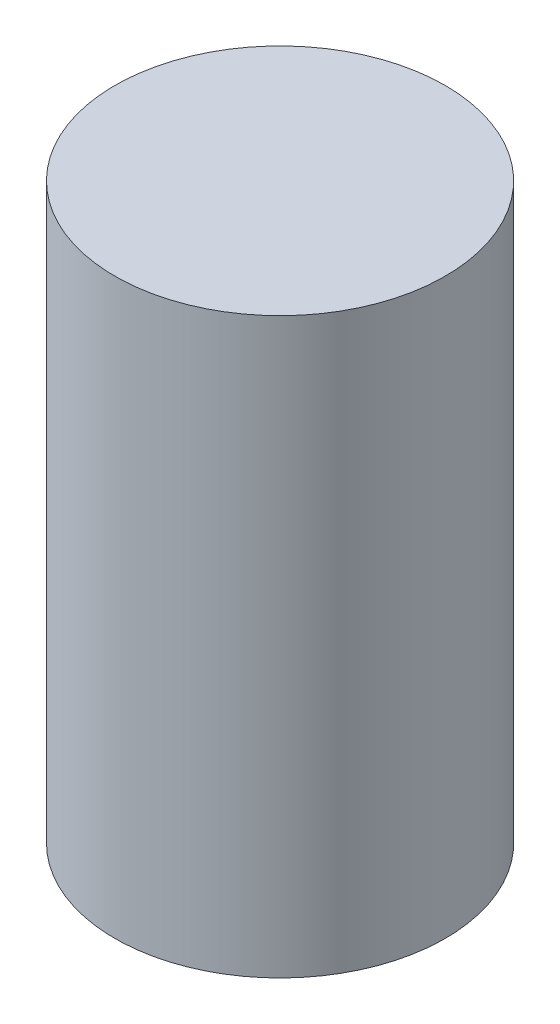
ISO-10303-21;
HEADER;
FILE_DESCRIPTION(('STEP AP214'),'2;1');
FILE_NAME('part.step','',(''),(''),'','','');
FILE_SCHEMA(('AUTOMOTIVE_DESIGN { 1 0 10303 214 1 1 1 1 }'));
ENDSEC;
DATA;
#1=APPLICATION_CONTEXT('core data for automotive mechanical design processes');
#2=APPLICATION_PROTOCOL_DEFINITION('international standard','automotive_design',2000,#1);
#3=PRODUCT_CONTEXT('',#1,'mechanical');
#4=PRODUCT('Part','Part','',(#3));
#5=PRODUCT_RELATED_PRODUCT_CATEGORY('part','',(#4));
#6=PRODUCT_DEFINITION_FORMATION('','',#4);
#7=PRODUCT_DEFINITION_CONTEXT('part definition',#1,'design');
#8=PRODUCT_DEFINITION('design','',#6,#7);
#9=PRODUCT_DEFINITION_SHAPE('','',#8);
#10=(LENGTH_UNIT() NAMED_UNIT(*) SI_UNIT(.MILLI.,.METRE.));
#11=(NAMED_UNIT(*) PLANE_ANGLE_UNIT() SI_UNIT($,.RADIAN.));
#12=(NAMED_UNIT(*) SI_UNIT($,.STERADIAN.) SOLID_ANGLE_UNIT());
#13=UNCERTAINTY_MEASURE_WITH_UNIT(LENGTH_MEASURE(1.E-05),#10,'distance_accuracy_value','');
#14=(GEOMETRIC_REPRESENTATION_CONTEXT(3) GLOBAL_UNCERTAINTY_ASSIGNED_CONTEXT((#13)) GLOBAL_UNIT_ASSIGNED_CONTEXT((#10,
#11,#12)) REPRESENTATION_CONTEXT('',''));
#15=CARTESIAN_POINT('',(0.,0.,0.));
#16=DIRECTION('',(0.,0.,1.));
#17=DIRECTION('',(1.,0.,0.));
#18=AXIS2_PLACEMENT_3D('',#15,#16,#17);
#19=CARTESIAN_POINT('',(0.,11.938,0.));
#20=DIRECTION('',(0.,-1.,0.));
#21=DIRECTION('',(0.,0.,-1.));
#22=AXIS2_PLACEMENT_3D('',#19,#20,#21);
#23=CYLINDRICAL_SURFACE('',#22,2.9845);
#24=CARTESIAN_POINT('',(0.,-10.3632,0.));
#25=DIRECTION('',(0.,-1.,0.));
#26=DIRECTION('',(0.,0.,-1.));
#27=AXIS2_PLACEMENT_3D('',#24,#25,#26);
#28=CIRCLE('',#27,2.9845);
#29=CARTESIAN_POINT('',(0.,-10.3632,-2.9845));
#30=VERTEX_POINT('',#29);
#31=EDGE_CURVE('E11',#30,#30,#28,.T.);
#32=ORIENTED_EDGE('',*,*,#31,.F.);
#33=EDGE_LOOP('',(#32));
#34=FACE_BOUND('',#33,.T.);
#35=CARTESIAN_POINT('',(0.,0.,0.));
#36=DIRECTION('',(0.,-1.,0.));
#37=DIRECTION('',(0.,0.,-1.));
#38=AXIS2_PLACEMENT_3D('',#35,#36,#37);
#39=CIRCLE('',#38,2.9845);
#40=CARTESIAN_POINT('',(0.,0.,-2.9845));
#41=VERTEX_POINT('',#40);
#42=EDGE_CURVE('E43',#41,#41,#39,.T.);
#43=ORIENTED_EDGE('',*,*,#42,.T.);
#44=EDGE_LOOP('',(#43));
#45=FACE_BOUND('',#44,.T.);
#46=CARTESIAN_POINT('',(-0.6206846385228,-4.40085155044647,-2.91924551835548));
#47=CARTESIAN_POINT('',(-0.680458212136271,-4.35944305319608,-2.90653651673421));
#48=CARTESIAN_POINT('',(-0.736452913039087,-4.3128487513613,-2.89270841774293));
#49=CARTESIAN_POINT('',(-0.840340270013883,-4.21149205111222,-2.8642599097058));
#50=CARTESIAN_POINT('',(-0.888213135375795,-4.15671029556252,-2.84963767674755));
#51=CARTESIAN_POINT('',(-0.978505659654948,-4.03695241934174,-2.81995940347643));
#52=CARTESIAN_POINT('',(-1.02036058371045,-3.97154304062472,-2.80493795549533));
#53=CARTESIAN_POINT('',(-1.09452036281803,-3.83518910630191,-2.77683950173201));
#54=CARTESIAN_POINT('',(-1.12682648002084,-3.76424528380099,-2.76376223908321));
#55=CARTESIAN_POINT('',(-1.18667481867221,-3.60526323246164,-2.73866485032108));
#56=CARTESIAN_POINT('',(-1.21235880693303,-3.51642333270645,-2.72724255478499));
#57=CARTESIAN_POINT('',(-1.25007105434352,-3.33534513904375,-2.71016493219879));
#58=CARTESIAN_POINT('',(-1.26209639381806,-3.24310612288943,-2.70451083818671));
#59=CARTESIAN_POINT('',(-1.27244243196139,-3.05477515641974,-2.69966109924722));
#60=CARTESIAN_POINT('',(-1.27032209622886,-2.95865301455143,-2.70067328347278));
#61=CARTESIAN_POINT('',(-1.25136872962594,-2.7681680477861,-2.70950567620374));
#62=CARTESIAN_POINT('',(-1.23453105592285,-2.67380578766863,-2.71732803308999));
#63=CARTESIAN_POINT('',(-1.18653172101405,-2.48994876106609,-2.73862432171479));
#64=CARTESIAN_POINT('',(-1.15543636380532,-2.40043358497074,-2.75207206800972));
#65=CARTESIAN_POINT('',(-1.07920805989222,-2.22827009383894,-2.78284665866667));
#66=CARTESIAN_POINT('',(-1.03407646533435,-2.14562111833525,-2.80017312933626));
#67=CARTESIAN_POINT('',(-0.938338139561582,-2.00247829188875,-2.83353095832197));
#68=CARTESIAN_POINT('',(-0.889776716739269,-1.94055846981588,-2.84932300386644));
#69=CARTESIAN_POINT('',(-0.78301321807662,-1.8255559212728,-2.88048806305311));
#70=CARTESIAN_POINT('',(-0.724825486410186,-1.77246027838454,-2.89586166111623));
#71=CARTESIAN_POINT('',(-0.612213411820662,-1.68745439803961,-2.92148006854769));
#72=CARTESIAN_POINT('',(-0.55947903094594,-1.65343299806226,-2.93212925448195));
#73=CARTESIAN_POINT('',(-0.448866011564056,-1.59417365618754,-2.95108426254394));
#74=CARTESIAN_POINT('',(-0.390990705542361,-1.56893007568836,-2.95939158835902));
#75=CARTESIAN_POINT('',(-0.270865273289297,-1.52866359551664,-2.97280090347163));
#76=CARTESIAN_POINT('',(-0.208584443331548,-1.51372226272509,-2.97787728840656));
#77=CARTESIAN_POINT('',(-0.0821428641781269,-1.4956306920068,-2.98403839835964));
#78=CARTESIAN_POINT('',(-0.0179835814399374,-1.49247149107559,-2.98512615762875));
#79=CARTESIAN_POINT('',(0.101546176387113,-1.49782910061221,-2.98329414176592));
#80=CARTESIAN_POINT('',(0.156995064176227,-1.50490976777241,-2.98086723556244));
#81=CARTESIAN_POINT('',(0.265853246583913,-1.52773991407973,-2.97313648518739));
#82=CARTESIAN_POINT('',(0.319262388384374,-1.54349004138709,-2.96783242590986));
#83=CARTESIAN_POINT('',(0.423318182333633,-1.58292595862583,-2.95479667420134));
#84=CARTESIAN_POINT('',(0.473932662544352,-1.60668794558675,-2.94704171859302));
#85=CARTESIAN_POINT('',(0.571053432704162,-1.66097558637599,-2.9297741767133));
#86=CARTESIAN_POINT('',(0.617557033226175,-1.69150562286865,-2.92026045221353));
#87=CARTESIAN_POINT('',(0.724922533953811,-1.77250860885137,-2.89584524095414));
#88=CARTESIAN_POINT('',(0.783437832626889,-1.82593099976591,-2.88037766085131));
#89=CARTESIAN_POINT('',(0.890744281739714,-1.94168437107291,-2.84902678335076));
#90=CARTESIAN_POINT('',(0.939520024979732,-2.00402920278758,-2.83314287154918));
#91=CARTESIAN_POINT('',(1.02775862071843,-2.1364005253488,-2.80234966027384));
#92=CARTESIAN_POINT('',(1.06709242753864,-2.20651618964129,-2.78745568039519));
#93=CARTESIAN_POINT('',(1.13551676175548,-2.35200264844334,-2.7602892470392));
#94=CARTESIAN_POINT('',(1.16460943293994,-2.42737233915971,-2.74801624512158));
#95=CARTESIAN_POINT('',(1.21617071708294,-2.59400291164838,-2.7256358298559));
#96=CARTESIAN_POINT('',(1.23688235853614,-2.68590097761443,-2.71617088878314));
#97=CARTESIAN_POINT('',(1.26410349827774,-2.87220979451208,-2.70361054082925));
#98=CARTESIAN_POINT('',(1.27061097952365,-2.96662090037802,-2.70051603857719));
#99=CARTESIAN_POINT('',(1.26929059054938,-3.15651791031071,-2.70113750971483));
#100=CARTESIAN_POINT('',(1.261280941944,-3.2520023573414,-2.70493984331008));
#101=CARTESIAN_POINT('',(1.2307135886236,-3.44016661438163,-2.71898163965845));
#102=CARTESIAN_POINT('',(1.20814848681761,-3.53284497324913,-2.72922437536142));
#103=CARTESIAN_POINT('',(1.14875148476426,-3.71286626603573,-2.75475078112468));
#104=CARTESIAN_POINT('',(1.11190642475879,-3.80020419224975,-2.77003909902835));
#105=CARTESIAN_POINT('',(1.02417212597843,-3.9669075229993,-2.80366069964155));
#106=CARTESIAN_POINT('',(0.973290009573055,-4.046276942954,-2.82199243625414));
#107=CARTESIAN_POINT('',(0.869733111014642,-4.17859155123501,-2.85536519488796));
#108=CARTESIAN_POINT('',(0.819647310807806,-4.23359488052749,-2.87029479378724));
#109=CARTESIAN_POINT('',(0.710973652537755,-4.33476248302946,-2.89912116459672));
#110=CARTESIAN_POINT('',(0.652398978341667,-4.38094020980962,-2.91301948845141));
#111=CARTESIAN_POINT('',(0.539353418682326,-4.45429959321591,-2.93581258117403));
#112=CARTESIAN_POINT('',(0.486238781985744,-4.48342512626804,-2.94515595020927));
#113=CARTESIAN_POINT('',(0.375673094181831,-4.53287153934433,-2.96128705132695));
#114=CARTESIAN_POINT('',(0.318225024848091,-4.5531984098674,-2.96807652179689));
#115=CARTESIAN_POINT('',(0.199998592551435,-4.5838163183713,-2.97838505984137));
#116=CARTESIAN_POINT('',(0.139201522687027,-4.59404329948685,-2.98188324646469));
#117=CARTESIAN_POINT('',(0.0166535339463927,-4.60340077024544,-2.98508166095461));
#118=CARTESIAN_POINT('',(-0.0450970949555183,-4.60253456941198,-2.98478302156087));
#119=CARTESIAN_POINT('',(-0.160900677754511,-4.5904685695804,-2.98066447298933));
#120=CARTESIAN_POINT('',(-0.215085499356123,-4.58035445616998,-2.97721455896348));
#121=CARTESIAN_POINT('',(-0.32098914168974,-4.55195710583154,-2.96766432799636));
#122=CARTESIAN_POINT('',(-0.372708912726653,-4.53367704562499,-2.96156504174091));
#123=CARTESIAN_POINT('',(-0.457514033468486,-4.49656722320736,-2.9494348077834));
#124=CARTESIAN_POINT('',(-0.491503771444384,-4.4795763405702,-2.94394126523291));
#125=CARTESIAN_POINT('',(-0.557563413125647,-4.44247332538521,-2.93214748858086));
#126=CARTESIAN_POINT('',(-0.589633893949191,-4.42236213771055,-2.92584749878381));
#127=CARTESIAN_POINT('',(-0.6206846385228,-4.40085155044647,-2.91924551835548));
#128=B_SPLINE_CURVE_WITH_KNOTS('',3,(#46,#47,#48,#49,#50,#51,#52,#53,#54,#55,#56,#57,#58,#59,
#60,#61,#62,#63,#64,#65,#66,#67,#68,#69,#70,#71,#72,#73,#74,#75,#76,#77,#78,#79,#80,#81,#82,#83,
#84,#85,#86,#87,#88,#89,#90,#91,#92,#93,#94,#95,#96,#97,#98,#99,#100,#101,#102,#103,#104,#105,
#106,#107,#108,#109,#110,#111,#112,#113,#114,#115,#116,#117,#118,#119,#120,#121,#122,#123,#124,
#125,#126,#127),.UNSPECIFIED.,.T.,.F.,(4,2,2,2,2,2,2,2,2,2,2,2,2,2,2,2,2,2,2,2,2,2,2,2,2,2,2,2,
2,2,2,2,2,2,2,2,2,2,2,2,4),(0.,0.22131898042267,0.443169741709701,0.679592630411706,
0.915984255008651,1.19425957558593,1.47259436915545,1.75964677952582,2.046789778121,
2.33261078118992,2.61840425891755,2.85827138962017,3.0977842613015,3.2880053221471,
3.47810396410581,3.66969092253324,3.86113210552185,4.0281855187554,4.19525142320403,
4.36395326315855,4.53276466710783,4.77364948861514,5.01491240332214,5.25930569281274,
5.50364779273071,5.78634988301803,6.06909211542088,6.35539923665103,6.64185197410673,
6.92856932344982,7.21514145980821,7.44192282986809,7.66835569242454,7.8515001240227,
8.0345196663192,8.21869266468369,8.40281071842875,8.56775208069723,8.73262933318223,
8.84763327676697,8.96260246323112),.UNSPECIFIED.);
#129=CARTESIAN_POINT('',(-0.6206846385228,-4.40085155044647,-2.91924551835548));
#130=VERTEX_POINT('',#129);
#131=EDGE_CURVE('E36',#130,#130,#128,.T.);
#132=ORIENTED_EDGE('',*,*,#131,.F.);
#133=EDGE_LOOP('',(#132));
#134=FACE_BOUND('',#133,.T.);
#135=ADVANCED_FACE('F32',(#34,#45,#134),#23,.T.);
#136=CARTESIAN_POINT('',(0.,-10.3632,0.));
#137=DIRECTION('',(0.,-1.,0.));
#138=DIRECTION('',(0.,0.,-1.));
#139=AXIS2_PLACEMENT_3D('',#136,#137,#138);
#140=PLANE('',#139);
#141=ORIENTED_EDGE('',*,*,#31,.T.);
#142=EDGE_LOOP('',(#141));
#143=FACE_BOUND('',#142,.T.);
#144=ADVANCED_FACE('F61',(#143),#140,.T.);
#145=CARTESIAN_POINT('',(0.,0.,0.));
#146=DIRECTION('',(0.,-1.,0.));
#147=DIRECTION('',(0.,0.,-1.));
#148=AXIS2_PLACEMENT_3D('',#145,#146,#147);
#149=PLANE('',#148);
#150=ORIENTED_EDGE('',*,*,#42,.F.);
#151=EDGE_LOOP('',(#150));
#152=FACE_BOUND('',#151,.T.);
#153=ADVANCED_FACE('F50',(#152),#149,.F.);
#154=CARTESIAN_POINT('',(0.,-3.048,-3.83246160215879));
#155=DIRECTION('',(0.,0.,-1.));
#156=DIRECTION('',(-1.,0.,0.));
#157=AXIS2_PLACEMENT_3D('',#154,#155,#156);
#158=CONICAL_SURFACE('',#157,2.40165797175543,0.785398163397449);
#159=CARTESIAN_POINT('',(0.,-3.048,-1.43080363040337));
#160=VERTEX_POINT('',#159);
#161=VERTEX_LOOP('',#160);
#162=FACE_BOUND('',#161,.T.);
#163=ORIENTED_EDGE('',*,*,#131,.T.);
#164=EDGE_LOOP('',(#163));
#165=FACE_BOUND('',#164,.T.);
#166=ADVANCED_FACE('F47',(#162,#165),#158,.F.);
#167=CLOSED_SHELL('',(#135,#144,#153,#166));
#168=MANIFOLD_SOLID_BREP('B2',#167);
#169=ADVANCED_BREP_SHAPE_REPRESENTATION('',(#18,#168),#14);
#170=SHAPE_DEFINITION_REPRESENTATION(#9,#169);
ENDSEC;
END-ISO-10303-21;
